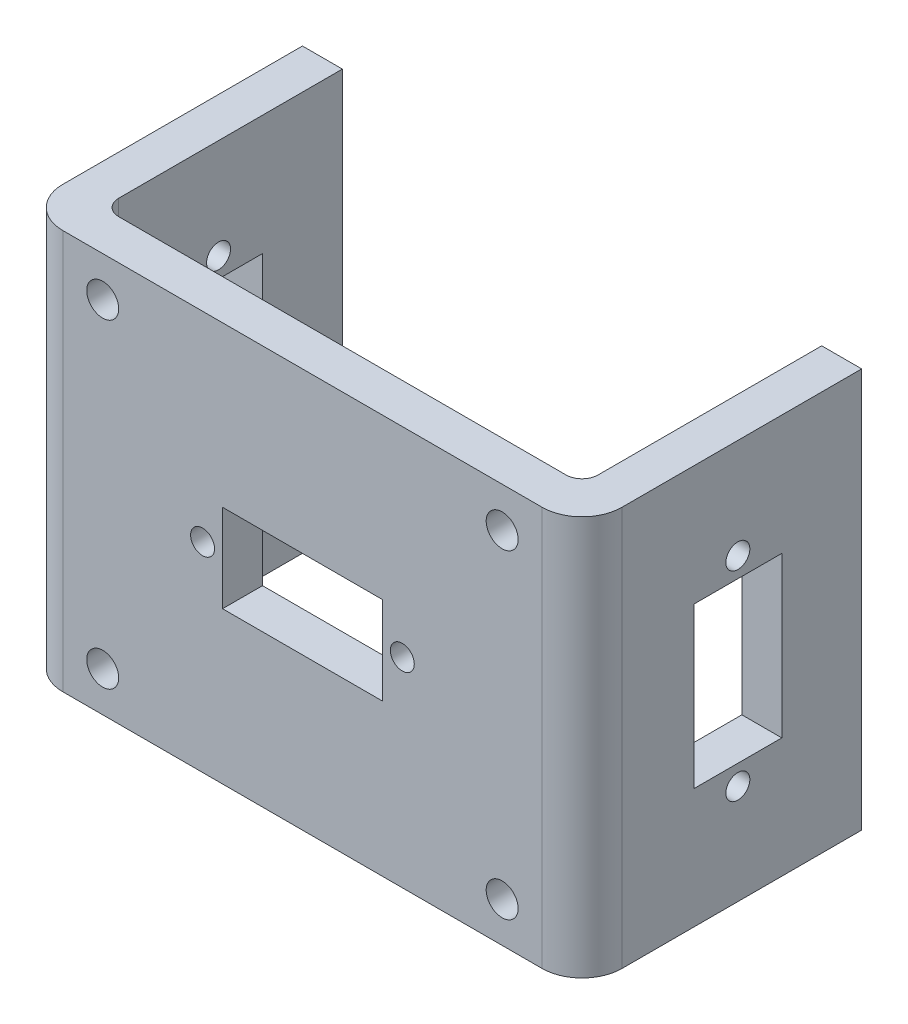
ISO-10303-21;
HEADER;
FILE_DESCRIPTION(('STEP AP214'),'2;1');
FILE_NAME('part.step','',(''),(''),'','','');
FILE_SCHEMA(('AUTOMOTIVE_DESIGN { 1 0 10303 214 1 1 1 1 }'));
ENDSEC;
DATA;
#1=APPLICATION_CONTEXT('core data for automotive mechanical design processes');
#2=APPLICATION_PROTOCOL_DEFINITION('international standard','automotive_design',2000,#1);
#3=PRODUCT_CONTEXT('',#1,'mechanical');
#4=PRODUCT('Part','Part','',(#3));
#5=PRODUCT_RELATED_PRODUCT_CATEGORY('part','',(#4));
#6=PRODUCT_DEFINITION_FORMATION('','',#4);
#7=PRODUCT_DEFINITION_CONTEXT('part definition',#1,'design');
#8=PRODUCT_DEFINITION('design','',#6,#7);
#9=PRODUCT_DEFINITION_SHAPE('','',#8);
#10=(LENGTH_UNIT() NAMED_UNIT(*) SI_UNIT(.MILLI.,.METRE.));
#11=(NAMED_UNIT(*) PLANE_ANGLE_UNIT() SI_UNIT($,.RADIAN.));
#12=(NAMED_UNIT(*) SI_UNIT($,.STERADIAN.) SOLID_ANGLE_UNIT());
#13=UNCERTAINTY_MEASURE_WITH_UNIT(LENGTH_MEASURE(1.E-05),#10,'distance_accuracy_value','');
#14=(GEOMETRIC_REPRESENTATION_CONTEXT(3) GLOBAL_UNCERTAINTY_ASSIGNED_CONTEXT((#13)) GLOBAL_UNIT_ASSIGNED_CONTEXT((#10,
#11,#12)) REPRESENTATION_CONTEXT('',''));
#15=CARTESIAN_POINT('',(0.,0.,0.));
#16=DIRECTION('',(0.,0.,1.));
#17=DIRECTION('',(1.,0.,0.));
#18=AXIS2_PLACEMENT_3D('',#15,#16,#17);
#19=CARTESIAN_POINT('',(0.,50.,0.));
#20=DIRECTION('',(0.,0.,-1.));
#21=DIRECTION('',(-1.,0.,0.));
#22=AXIS2_PLACEMENT_3D('',#19,#20,#21);
#23=PLANE('',#22);
#24=DIRECTION('',(0.,1.,0.));
#25=VECTOR('',#24,1.);
#26=CARTESIAN_POINT('',(65.,0.,0.));
#27=LINE('',#26,#25);
#28=CARTESIAN_POINT('',(65.,0.,0.));
#29=VERTEX_POINT('',#28);
#30=CARTESIAN_POINT('',(65.,50.,0.));
#31=VERTEX_POINT('',#30);
#32=EDGE_CURVE('E339',#29,#31,#27,.T.);
#33=ORIENTED_EDGE('',*,*,#32,.T.);
#34=DIRECTION('',(-1.,0.,0.));
#35=VECTOR('',#34,1.);
#36=CARTESIAN_POINT('',(0.,50.,0.));
#37=LINE('',#36,#35);
#38=CARTESIAN_POINT('',(70.,50.,0.));
#39=VERTEX_POINT('',#38);
#40=EDGE_CURVE('E369',#39,#31,#37,.T.);
#41=ORIENTED_EDGE('',*,*,#40,.F.);
#42=DIRECTION('',(0.,1.,0.));
#43=VECTOR('',#42,1.);
#44=CARTESIAN_POINT('',(70.,0.,0.));
#45=LINE('',#44,#43);
#46=CARTESIAN_POINT('',(70.,0.,0.));
#47=VERTEX_POINT('',#46);
#48=EDGE_CURVE('E379',#47,#39,#45,.T.);
#49=ORIENTED_EDGE('',*,*,#48,.F.);
#50=DIRECTION('',(1.,0.,0.));
#51=VECTOR('',#50,1.);
#52=CARTESIAN_POINT('',(0.,0.,0.));
#53=LINE('',#52,#51);
#54=EDGE_CURVE('E375',#29,#47,#53,.T.);
#55=ORIENTED_EDGE('',*,*,#54,.F.);
#56=EDGE_LOOP('',(#33,#41,#49,#55));
#57=FACE_BOUND('',#56,.T.);
#58=ADVANCED_FACE('F30',(#57),#23,.T.);
#59=CARTESIAN_POINT('',(0.,0.,35.));
#60=DIRECTION('',(1.,0.,0.));
#61=DIRECTION('',(0.,1.,0.));
#62=AXIS2_PLACEMENT_3D('',#59,#60,#61);
#63=PLANE('',#62);
#64=CARTESIAN_POINT('',(0.,37.5,15.5));
#65=DIRECTION('',(-1.,0.,0.));
#66=DIRECTION('',(0.,-1.,0.));
#67=AXIS2_PLACEMENT_3D('',#64,#65,#66);
#68=CIRCLE('',#67,1.5);
#69=CARTESIAN_POINT('',(0.,36.,15.5));
#70=VERTEX_POINT('',#69);
#71=EDGE_CURVE('E207',#70,#70,#68,.T.);
#72=ORIENTED_EDGE('',*,*,#71,.F.);
#73=EDGE_LOOP('',(#72));
#74=FACE_BOUND('',#73,.T.);
#75=CARTESIAN_POINT('',(0.,12.5,15.5));
#76=DIRECTION('',(-1.,0.,0.));
#77=DIRECTION('',(0.,-1.,0.));
#78=AXIS2_PLACEMENT_3D('',#75,#76,#77);
#79=CIRCLE('',#78,1.5);
#80=CARTESIAN_POINT('',(0.,11.,15.5));
#81=VERTEX_POINT('',#80);
#82=EDGE_CURVE('E238',#81,#81,#79,.T.);
#83=ORIENTED_EDGE('',*,*,#82,.F.);
#84=EDGE_LOOP('',(#83));
#85=FACE_BOUND('',#84,.T.);
#86=DIRECTION('',(0.,0.,1.));
#87=VECTOR('',#86,1.);
#88=CARTESIAN_POINT('',(0.,15.,10.));
#89=LINE('',#88,#87);
#90=CARTESIAN_POINT('',(0.,15.,10.));
#91=VERTEX_POINT('',#90);
#92=CARTESIAN_POINT('',(0.,15.,21.));
#93=VERTEX_POINT('',#92);
#94=EDGE_CURVE('E264',#91,#93,#89,.T.);
#95=ORIENTED_EDGE('',*,*,#94,.F.);
#96=DIRECTION('',(0.,-1.,0.));
#97=VECTOR('',#96,1.);
#98=CARTESIAN_POINT('',(0.,35.,10.));
#99=LINE('',#98,#97);
#100=CARTESIAN_POINT('',(0.,35.,10.));
#101=VERTEX_POINT('',#100);
#102=EDGE_CURVE('E248',#101,#91,#99,.T.);
#103=ORIENTED_EDGE('',*,*,#102,.F.);
#104=DIRECTION('',(0.,0.,-1.));
#105=VECTOR('',#104,1.);
#106=CARTESIAN_POINT('',(0.,35.,10.));
#107=LINE('',#106,#105);
#108=CARTESIAN_POINT('',(0.,35.,21.));
#109=VERTEX_POINT('',#108);
#110=EDGE_CURVE('E253',#109,#101,#107,.T.);
#111=ORIENTED_EDGE('',*,*,#110,.F.);
#112=DIRECTION('',(0.,1.,0.));
#113=VECTOR('',#112,1.);
#114=CARTESIAN_POINT('',(0.,35.,21.));
#115=LINE('',#114,#113);
#116=EDGE_CURVE('E267',#93,#109,#115,.T.);
#117=ORIENTED_EDGE('',*,*,#116,.F.);
#118=EDGE_LOOP('',(#95,#103,#111,#117));
#119=FACE_BOUND('',#118,.T.);
#120=DIRECTION('',(0.,0.,-1.));
#121=VECTOR('',#120,1.);
#122=CARTESIAN_POINT('',(0.,0.,35.));
#123=LINE('',#122,#121);
#124=CARTESIAN_POINT('',(0.,0.,30.));
#125=VERTEX_POINT('',#124);
#126=CARTESIAN_POINT('',(0.,0.,0.));
#127=VERTEX_POINT('',#126);
#128=EDGE_CURVE('E392',#125,#127,#123,.T.);
#129=ORIENTED_EDGE('',*,*,#128,.F.);
#130=DIRECTION('',(0.,-1.,0.));
#131=VECTOR('',#130,1.);
#132=CARTESIAN_POINT('',(0.,0.,30.));
#133=LINE('',#132,#131);
#134=CARTESIAN_POINT('',(0.,50.,30.));
#135=VERTEX_POINT('',#134);
#136=EDGE_CURVE('E410',#125,#135,#133,.F.);
#137=ORIENTED_EDGE('',*,*,#136,.T.);
#138=DIRECTION('',(0.,0.,-1.));
#139=VECTOR('',#138,1.);
#140=CARTESIAN_POINT('',(0.,50.,35.));
#141=LINE('',#140,#139);
#142=CARTESIAN_POINT('',(0.,50.,0.));
#143=VERTEX_POINT('',#142);
#144=EDGE_CURVE('E372',#135,#143,#141,.T.);
#145=ORIENTED_EDGE('',*,*,#144,.T.);
#146=DIRECTION('',(0.,-1.,0.));
#147=VECTOR('',#146,1.);
#148=CARTESIAN_POINT('',(0.,0.,0.));
#149=LINE('',#148,#147);
#150=EDGE_CURVE('E354',#143,#127,#149,.T.);
#151=ORIENTED_EDGE('',*,*,#150,.T.);
#152=EDGE_LOOP('',(#129,#137,#145,#151));
#153=FACE_BOUND('',#152,.T.);
#154=ADVANCED_FACE('F444',(#74,#85,#119,#153),#63,.F.);
#155=CARTESIAN_POINT('',(0.,0.,35.));
#156=DIRECTION('',(0.,1.,0.));
#157=DIRECTION('',(0.,0.,1.));
#158=AXIS2_PLACEMENT_3D('',#155,#156,#157);
#159=PLANE('',#158);
#160=CARTESIAN_POINT('',(63.,0.,28.));
#161=DIRECTION('',(0.,1.,0.));
#162=DIRECTION('',(0.,0.,1.));
#163=AXIS2_PLACEMENT_3D('',#160,#161,#162);
#164=CIRCLE('',#163,1.99999999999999);
#165=CARTESIAN_POINT('',(63.,0.,30.));
#166=VERTEX_POINT('',#165);
#167=CARTESIAN_POINT('',(65.,0.,28.));
#168=VERTEX_POINT('',#167);
#169=EDGE_CURVE('E336',#166,#168,#164,.T.);
#170=ORIENTED_EDGE('',*,*,#169,.T.);
#171=DIRECTION('',(0.,0.,-1.));
#172=VECTOR('',#171,1.);
#173=CARTESIAN_POINT('',(65.,0.,0.));
#174=LINE('',#173,#172);
#175=EDGE_CURVE('E323',#168,#29,#174,.T.);
#176=ORIENTED_EDGE('',*,*,#175,.T.);
#177=ORIENTED_EDGE('',*,*,#54,.T.);
#178=DIRECTION('',(0.,0.,-1.));
#179=VECTOR('',#178,1.);
#180=CARTESIAN_POINT('',(70.,0.,35.));
#181=LINE('',#180,#179);
#182=CARTESIAN_POINT('',(70.,0.,30.));
#183=VERTEX_POINT('',#182);
#184=EDGE_CURVE('E389',#183,#47,#181,.T.);
#185=ORIENTED_EDGE('',*,*,#184,.F.);
#186=CARTESIAN_POINT('',(65.,0.,30.));
#187=DIRECTION('',(0.,1.,0.));
#188=DIRECTION('',(0.,0.,1.));
#189=AXIS2_PLACEMENT_3D('',#186,#187,#188);
#190=CIRCLE('',#189,5.);
#191=CARTESIAN_POINT('',(65.,0.,35.));
#192=VERTEX_POINT('',#191);
#193=EDGE_CURVE('E408',#183,#192,#190,.F.);
#194=ORIENTED_EDGE('',*,*,#193,.T.);
#195=DIRECTION('',(1.,0.,0.));
#196=VECTOR('',#195,1.);
#197=CARTESIAN_POINT('',(0.,0.,35.));
#198=LINE('',#197,#196);
#199=CARTESIAN_POINT('',(5.,0.,35.));
#200=VERTEX_POINT('',#199);
#201=EDGE_CURVE('E365',#200,#192,#198,.T.);
#202=ORIENTED_EDGE('',*,*,#201,.F.);
#203=CARTESIAN_POINT('',(5.,0.,30.));
#204=DIRECTION('',(0.,1.,0.));
#205=DIRECTION('',(0.,0.,1.));
#206=AXIS2_PLACEMENT_3D('',#203,#204,#205);
#207=CIRCLE('',#206,5.);
#208=EDGE_CURVE('E406',#200,#125,#207,.F.);
#209=ORIENTED_EDGE('',*,*,#208,.T.);
#210=ORIENTED_EDGE('',*,*,#128,.T.);
#211=CARTESIAN_POINT('',(4.99999999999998,0.,0.));
#212=VERTEX_POINT('',#211);
#213=EDGE_CURVE('E376',#127,#212,#53,.T.);
#214=ORIENTED_EDGE('',*,*,#213,.T.);
#215=DIRECTION('',(0.,0.,1.));
#216=VECTOR('',#215,1.);
#217=CARTESIAN_POINT('',(4.99999999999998,0.,0.));
#218=LINE('',#217,#216);
#219=CARTESIAN_POINT('',(4.99999999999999,0.,28.));
#220=VERTEX_POINT('',#219);
#221=EDGE_CURVE('E326',#212,#220,#218,.T.);
#222=ORIENTED_EDGE('',*,*,#221,.T.);
#223=CARTESIAN_POINT('',(6.99999999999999,0.,28.));
#224=DIRECTION('',(0.,1.,0.));
#225=DIRECTION('',(0.,0.,1.));
#226=AXIS2_PLACEMENT_3D('',#223,#224,#225);
#227=CIRCLE('',#226,2.);
#228=CARTESIAN_POINT('',(6.99999999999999,0.,30.));
#229=VERTEX_POINT('',#228);
#230=EDGE_CURVE('E330',#220,#229,#227,.T.);
#231=ORIENTED_EDGE('',*,*,#230,.T.);
#232=DIRECTION('',(1.,0.,0.));
#233=VECTOR('',#232,1.);
#234=CARTESIAN_POINT('',(63.,0.,30.));
#235=LINE('',#234,#233);
#236=EDGE_CURVE('E333',#229,#166,#235,.T.);
#237=ORIENTED_EDGE('',*,*,#236,.T.);
#238=EDGE_LOOP('',(#170,#176,#177,#185,#194,#202,#209,#210,#214,#222,#231,#237));
#239=FACE_BOUND('',#238,.T.);
#240=ADVANCED_FACE('F451',(#239),#159,.F.);
#241=CARTESIAN_POINT('',(70.,0.,35.));
#242=DIRECTION('',(-1.,0.,0.));
#243=DIRECTION('',(0.,-1.,0.));
#244=AXIS2_PLACEMENT_3D('',#241,#242,#243);
#245=PLANE('',#244);
#246=CARTESIAN_POINT('',(70.,37.5,15.5));
#247=DIRECTION('',(-1.,0.,0.));
#248=DIRECTION('',(0.,-1.,0.));
#249=AXIS2_PLACEMENT_3D('',#246,#247,#248);
#250=CIRCLE('',#249,1.5);
#251=CARTESIAN_POINT('',(70.,36.,15.5));
#252=VERTEX_POINT('',#251);
#253=EDGE_CURVE('E230',#252,#252,#250,.T.);
#254=ORIENTED_EDGE('',*,*,#253,.T.);
#255=EDGE_LOOP('',(#254));
#256=FACE_BOUND('',#255,.T.);
#257=CARTESIAN_POINT('',(70.,12.5,15.5));
#258=DIRECTION('',(-1.,0.,0.));
#259=DIRECTION('',(0.,-1.,0.));
#260=AXIS2_PLACEMENT_3D('',#257,#258,#259);
#261=CIRCLE('',#260,1.5);
#262=CARTESIAN_POINT('',(70.,11.,15.5));
#263=VERTEX_POINT('',#262);
#264=EDGE_CURVE('E239',#263,#263,#261,.T.);
#265=ORIENTED_EDGE('',*,*,#264,.T.);
#266=EDGE_LOOP('',(#265));
#267=FACE_BOUND('',#266,.T.);
#268=DIRECTION('',(0.,0.,-1.));
#269=VECTOR('',#268,1.);
#270=CARTESIAN_POINT('',(70.,35.,10.));
#271=LINE('',#270,#269);
#272=CARTESIAN_POINT('',(70.,35.,21.));
#273=VERTEX_POINT('',#272);
#274=CARTESIAN_POINT('',(70.,35.,10.));
#275=VERTEX_POINT('',#274);
#276=EDGE_CURVE('E259',#273,#275,#271,.T.);
#277=ORIENTED_EDGE('',*,*,#276,.T.);
#278=DIRECTION('',(0.,-1.,0.));
#279=VECTOR('',#278,1.);
#280=CARTESIAN_POINT('',(70.,35.,10.));
#281=LINE('',#280,#279);
#282=CARTESIAN_POINT('',(70.,15.,10.));
#283=VERTEX_POINT('',#282);
#284=EDGE_CURVE('E249',#275,#283,#281,.T.);
#285=ORIENTED_EDGE('',*,*,#284,.T.);
#286=DIRECTION('',(0.,0.,1.));
#287=VECTOR('',#286,1.);
#288=CARTESIAN_POINT('',(70.,15.,10.));
#289=LINE('',#288,#287);
#290=CARTESIAN_POINT('',(70.,15.,21.));
#291=VERTEX_POINT('',#290);
#292=EDGE_CURVE('E252',#283,#291,#289,.T.);
#293=ORIENTED_EDGE('',*,*,#292,.T.);
#294=DIRECTION('',(0.,1.,0.));
#295=VECTOR('',#294,1.);
#296=CARTESIAN_POINT('',(70.,35.,21.));
#297=LINE('',#296,#295);
#298=EDGE_CURVE('E256',#291,#273,#297,.T.);
#299=ORIENTED_EDGE('',*,*,#298,.T.);
#300=EDGE_LOOP('',(#277,#285,#293,#299));
#301=FACE_BOUND('',#300,.T.);
#302=DIRECTION('',(0.,0.,-1.));
#303=VECTOR('',#302,1.);
#304=CARTESIAN_POINT('',(70.,50.,35.));
#305=LINE('',#304,#303);
#306=CARTESIAN_POINT('',(70.,50.,30.));
#307=VERTEX_POINT('',#306);
#308=EDGE_CURVE('E387',#307,#39,#305,.T.);
#309=ORIENTED_EDGE('',*,*,#308,.F.);
#310=DIRECTION('',(0.,1.,0.));
#311=VECTOR('',#310,1.);
#312=CARTESIAN_POINT('',(70.,0.,30.));
#313=LINE('',#312,#311);
#314=EDGE_CURVE('E404',#307,#183,#313,.F.);
#315=ORIENTED_EDGE('',*,*,#314,.T.);
#316=ORIENTED_EDGE('',*,*,#184,.T.);
#317=ORIENTED_EDGE('',*,*,#48,.T.);
#318=EDGE_LOOP('',(#309,#315,#316,#317));
#319=FACE_BOUND('',#318,.T.);
#320=ADVANCED_FACE('F490',(#256,#267,#301,#319),#245,.F.);
#321=CARTESIAN_POINT('',(0.,50.,35.));
#322=DIRECTION('',(0.,-1.,0.));
#323=DIRECTION('',(0.,0.,-1.));
#324=AXIS2_PLACEMENT_3D('',#321,#322,#323);
#325=PLANE('',#324);
#326=ORIENTED_EDGE('',*,*,#40,.T.);
#327=DIRECTION('',(0.,0.,-1.));
#328=VECTOR('',#327,1.);
#329=CARTESIAN_POINT('',(65.,50.,0.));
#330=LINE('',#329,#328);
#331=CARTESIAN_POINT('',(65.,50.,28.));
#332=VERTEX_POINT('',#331);
#333=EDGE_CURVE('E322',#332,#31,#330,.T.);
#334=ORIENTED_EDGE('',*,*,#333,.F.);
#335=CARTESIAN_POINT('',(63.,50.,28.));
#336=DIRECTION('',(0.,1.,0.));
#337=DIRECTION('',(0.,0.,1.));
#338=AXIS2_PLACEMENT_3D('',#335,#336,#337);
#339=CIRCLE('',#338,1.99999999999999);
#340=CARTESIAN_POINT('',(63.,50.,30.));
#341=VERTEX_POINT('',#340);
#342=EDGE_CURVE('E327',#341,#332,#339,.T.);
#343=ORIENTED_EDGE('',*,*,#342,.F.);
#344=DIRECTION('',(1.,0.,0.));
#345=VECTOR('',#344,1.);
#346=CARTESIAN_POINT('',(63.,50.,30.));
#347=LINE('',#346,#345);
#348=CARTESIAN_POINT('',(6.99999999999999,50.,30.));
#349=VERTEX_POINT('',#348);
#350=EDGE_CURVE('E347',#349,#341,#347,.T.);
#351=ORIENTED_EDGE('',*,*,#350,.F.);
#352=CARTESIAN_POINT('',(6.99999999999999,50.,28.));
#353=DIRECTION('',(0.,1.,0.));
#354=DIRECTION('',(0.,0.,1.));
#355=AXIS2_PLACEMENT_3D('',#352,#353,#354);
#356=CIRCLE('',#355,2.);
#357=CARTESIAN_POINT('',(4.99999999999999,50.,28.));
#358=VERTEX_POINT('',#357);
#359=EDGE_CURVE('E344',#358,#349,#356,.T.);
#360=ORIENTED_EDGE('',*,*,#359,.F.);
#361=DIRECTION('',(0.,0.,1.));
#362=VECTOR('',#361,1.);
#363=CARTESIAN_POINT('',(4.99999999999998,50.,0.));
#364=LINE('',#363,#362);
#365=CARTESIAN_POINT('',(4.99999999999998,50.,0.));
#366=VERTEX_POINT('',#365);
#367=EDGE_CURVE('E341',#366,#358,#364,.T.);
#368=ORIENTED_EDGE('',*,*,#367,.F.);
#369=EDGE_CURVE('E382',#366,#143,#37,.T.);
#370=ORIENTED_EDGE('',*,*,#369,.T.);
#371=ORIENTED_EDGE('',*,*,#144,.F.);
#372=CARTESIAN_POINT('',(4.99999999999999,50.,30.));
#373=DIRECTION('',(0.,-1.,0.));
#374=DIRECTION('',(0.,0.,-1.));
#375=AXIS2_PLACEMENT_3D('',#372,#373,#374);
#376=CIRCLE('',#375,5.);
#377=CARTESIAN_POINT('',(4.99999999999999,50.,35.));
#378=VERTEX_POINT('',#377);
#379=EDGE_CURVE('E400',#135,#378,#376,.F.);
#380=ORIENTED_EDGE('',*,*,#379,.T.);
#381=DIRECTION('',(-1.,0.,0.));
#382=VECTOR('',#381,1.);
#383=CARTESIAN_POINT('',(0.,50.,35.));
#384=LINE('',#383,#382);
#385=CARTESIAN_POINT('',(65.,50.,35.));
#386=VERTEX_POINT('',#385);
#387=EDGE_CURVE('E368',#386,#378,#384,.T.);
#388=ORIENTED_EDGE('',*,*,#387,.F.);
#389=CARTESIAN_POINT('',(65.,50.,30.));
#390=DIRECTION('',(0.,-1.,0.));
#391=DIRECTION('',(0.,0.,-1.));
#392=AXIS2_PLACEMENT_3D('',#389,#390,#391);
#393=CIRCLE('',#392,5.);
#394=EDGE_CURVE('E402',#386,#307,#393,.F.);
#395=ORIENTED_EDGE('',*,*,#394,.T.);
#396=ORIENTED_EDGE('',*,*,#308,.T.);
#397=EDGE_LOOP('',(#326,#334,#343,#351,#360,#368,#370,#371,#380,#388,#395,#396));
#398=FACE_BOUND('',#397,.T.);
#399=ADVANCED_FACE('F465',(#398),#325,.F.);
#400=CARTESIAN_POINT('',(0.,50.,35.));
#401=DIRECTION('',(0.,0.,-1.));
#402=DIRECTION('',(-1.,0.,0.));
#403=AXIS2_PLACEMENT_3D('',#400,#401,#402);
#404=PLANE('',#403);
#405=CARTESIAN_POINT('',(47.5,25.,35.));
#406=DIRECTION('',(0.,0.,1.));
#407=DIRECTION('',(1.,0.,0.));
#408=AXIS2_PLACEMENT_3D('',#405,#406,#407);
#409=CIRCLE('',#408,1.5);
#410=CARTESIAN_POINT('',(49.,25.,35.));
#411=VERTEX_POINT('',#410);
#412=EDGE_CURVE('E608',#411,#411,#409,.T.);
#413=ORIENTED_EDGE('',*,*,#412,.F.);
#414=EDGE_LOOP('',(#413));
#415=FACE_BOUND('',#414,.T.);
#416=CARTESIAN_POINT('',(22.5,25.,35.));
#417=DIRECTION('',(0.,0.,1.));
#418=DIRECTION('',(1.,0.,0.));
#419=AXIS2_PLACEMENT_3D('',#416,#417,#418);
#420=CIRCLE('',#419,1.5);
#421=CARTESIAN_POINT('',(24.,25.,35.));
#422=VERTEX_POINT('',#421);
#423=EDGE_CURVE('E602',#422,#422,#420,.T.);
#424=ORIENTED_EDGE('',*,*,#423,.F.);
#425=EDGE_LOOP('',(#424));
#426=FACE_BOUND('',#425,.T.);
#427=DIRECTION('',(1.,0.,0.));
#428=VECTOR('',#427,1.);
#429=CARTESIAN_POINT('',(25.,19.,35.));
#430=LINE('',#429,#428);
#431=CARTESIAN_POINT('',(25.,19.,35.));
#432=VERTEX_POINT('',#431);
#433=CARTESIAN_POINT('',(45.,19.,35.));
#434=VERTEX_POINT('',#433);
#435=EDGE_CURVE('E215',#432,#434,#430,.T.);
#436=ORIENTED_EDGE('',*,*,#435,.F.);
#437=DIRECTION('',(0.,-1.,0.));
#438=VECTOR('',#437,1.);
#439=CARTESIAN_POINT('',(25.,19.,35.));
#440=LINE('',#439,#438);
#441=CARTESIAN_POINT('',(25.,30.,35.));
#442=VERTEX_POINT('',#441);
#443=EDGE_CURVE('E47',#442,#432,#440,.T.);
#444=ORIENTED_EDGE('',*,*,#443,.F.);
#445=DIRECTION('',(-1.,0.,0.));
#446=VECTOR('',#445,1.);
#447=CARTESIAN_POINT('',(25.,30.,35.));
#448=LINE('',#447,#446);
#449=CARTESIAN_POINT('',(45.,30.,35.));
#450=VERTEX_POINT('',#449);
#451=EDGE_CURVE('E201',#450,#442,#448,.T.);
#452=ORIENTED_EDGE('',*,*,#451,.F.);
#453=DIRECTION('',(0.,1.,0.));
#454=VECTOR('',#453,1.);
#455=CARTESIAN_POINT('',(45.,19.,35.));
#456=LINE('',#455,#454);
#457=EDGE_CURVE('E221',#434,#450,#456,.T.);
#458=ORIENTED_EDGE('',*,*,#457,.F.);
#459=EDGE_LOOP('',(#436,#444,#452,#458));
#460=FACE_BOUND('',#459,.T.);
#461=CARTESIAN_POINT('',(60.,45.,35.));
#462=DIRECTION('',(0.,0.,1.));
#463=DIRECTION('',(1.,0.,0.));
#464=AXIS2_PLACEMENT_3D('',#461,#462,#463);
#465=CIRCLE('',#464,2.);
#466=CARTESIAN_POINT('',(62.,45.,35.));
#467=VERTEX_POINT('',#466);
#468=EDGE_CURVE('E298',#467,#467,#465,.T.);
#469=ORIENTED_EDGE('',*,*,#468,.F.);
#470=EDGE_LOOP('',(#469));
#471=FACE_BOUND('',#470,.T.);
#472=CARTESIAN_POINT('',(60.,5.,35.));
#473=DIRECTION('',(0.,0.,1.));
#474=DIRECTION('',(1.,0.,0.));
#475=AXIS2_PLACEMENT_3D('',#472,#473,#474);
#476=CIRCLE('',#475,2.);
#477=CARTESIAN_POINT('',(62.,5.,35.));
#478=VERTEX_POINT('',#477);
#479=EDGE_CURVE('E304',#478,#478,#476,.T.);
#480=ORIENTED_EDGE('',*,*,#479,.F.);
#481=EDGE_LOOP('',(#480));
#482=FACE_BOUND('',#481,.T.);
#483=CARTESIAN_POINT('',(9.99999999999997,5.00000000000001,35.));
#484=DIRECTION('',(0.,0.,1.));
#485=DIRECTION('',(1.,0.,0.));
#486=AXIS2_PLACEMENT_3D('',#483,#484,#485);
#487=CIRCLE('',#486,2.);
#488=CARTESIAN_POINT('',(12.,5.00000000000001,35.));
#489=VERTEX_POINT('',#488);
#490=EDGE_CURVE('E310',#489,#489,#487,.T.);
#491=ORIENTED_EDGE('',*,*,#490,.F.);
#492=EDGE_LOOP('',(#491));
#493=FACE_BOUND('',#492,.T.);
#494=CARTESIAN_POINT('',(9.99999999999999,45.,35.));
#495=DIRECTION('',(0.,0.,1.));
#496=DIRECTION('',(1.,0.,0.));
#497=AXIS2_PLACEMENT_3D('',#494,#495,#496);
#498=CIRCLE('',#497,2.);
#499=CARTESIAN_POINT('',(12.,45.,35.));
#500=VERTEX_POINT('',#499);
#501=EDGE_CURVE('E316',#500,#500,#498,.T.);
#502=ORIENTED_EDGE('',*,*,#501,.F.);
#503=EDGE_LOOP('',(#502));
#504=FACE_BOUND('',#503,.T.);
#505=ORIENTED_EDGE('',*,*,#201,.T.);
#506=DIRECTION('',(0.,1.,0.));
#507=VECTOR('',#506,1.);
#508=CARTESIAN_POINT('',(65.,50.,35.));
#509=LINE('',#508,#507);
#510=EDGE_CURVE('E397',#192,#386,#509,.T.);
#511=ORIENTED_EDGE('',*,*,#510,.T.);
#512=ORIENTED_EDGE('',*,*,#387,.T.);
#513=DIRECTION('',(0.,-1.,0.));
#514=VECTOR('',#513,1.);
#515=CARTESIAN_POINT('',(4.99999999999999,50.,35.));
#516=LINE('',#515,#514);
#517=EDGE_CURVE('E394',#378,#200,#516,.T.);
#518=ORIENTED_EDGE('',*,*,#517,.T.);
#519=EDGE_LOOP('',(#505,#511,#512,#518));
#520=FACE_BOUND('',#519,.T.);
#521=ADVANCED_FACE('F458',(#415,#426,#460,#471,#482,#493,#504,#520),#404,.F.);
#522=DIRECTION('',(0.,1.,0.));
#523=VECTOR('',#522,1.);
#524=CARTESIAN_POINT('',(4.99999999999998,0.,0.));
#525=LINE('',#524,#523);
#526=EDGE_CURVE('E361',#212,#366,#525,.T.);
#527=ORIENTED_EDGE('',*,*,#526,.F.);
#528=ORIENTED_EDGE('',*,*,#213,.F.);
#529=ORIENTED_EDGE('',*,*,#150,.F.);
#530=ORIENTED_EDGE('',*,*,#369,.F.);
#531=EDGE_LOOP('',(#527,#528,#529,#530));
#532=FACE_BOUND('',#531,.T.);
#533=ADVANCED_FACE('F447',(#532),#23,.T.);
#534=CARTESIAN_POINT('',(65.,50.,30.));
#535=DIRECTION('',(0.,1.,0.));
#536=DIRECTION('',(-1.,0.,0.));
#537=AXIS2_PLACEMENT_3D('',#534,#535,#536);
#538=CYLINDRICAL_SURFACE('',#537,5.);
#539=ORIENTED_EDGE('',*,*,#193,.F.);
#540=ORIENTED_EDGE('',*,*,#314,.F.);
#541=ORIENTED_EDGE('',*,*,#394,.F.);
#542=ORIENTED_EDGE('',*,*,#510,.F.);
#543=EDGE_LOOP('',(#539,#540,#541,#542));
#544=FACE_BOUND('',#543,.T.);
#545=ADVANCED_FACE('F457',(#544),#538,.T.);
#546=CARTESIAN_POINT('',(4.99999999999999,50.,30.));
#547=DIRECTION('',(0.,-1.,0.));
#548=DIRECTION('',(1.,0.,0.));
#549=AXIS2_PLACEMENT_3D('',#546,#547,#548);
#550=CYLINDRICAL_SURFACE('',#549,5.);
#551=ORIENTED_EDGE('',*,*,#379,.F.);
#552=ORIENTED_EDGE('',*,*,#136,.F.);
#553=ORIENTED_EDGE('',*,*,#208,.F.);
#554=ORIENTED_EDGE('',*,*,#517,.F.);
#555=EDGE_LOOP('',(#551,#552,#553,#554));
#556=FACE_BOUND('',#555,.T.);
#557=ADVANCED_FACE('F32',(#556),#550,.T.);
#558=CARTESIAN_POINT('',(65.,0.,0.));
#559=DIRECTION('',(1.,0.,0.));
#560=DIRECTION('',(0.,0.,-1.));
#561=AXIS2_PLACEMENT_3D('',#558,#559,#560);
#562=PLANE('',#561);
#563=CARTESIAN_POINT('',(65.,37.5,15.5));
#564=DIRECTION('',(1.,0.,0.));
#565=DIRECTION('',(0.,0.,-1.));
#566=AXIS2_PLACEMENT_3D('',#563,#564,#565);
#567=CIRCLE('',#566,1.5);
#568=CARTESIAN_POINT('',(65.,37.5,14.));
#569=VERTEX_POINT('',#568);
#570=EDGE_CURVE('E235',#569,#569,#567,.T.);
#571=ORIENTED_EDGE('',*,*,#570,.T.);
#572=EDGE_LOOP('',(#571));
#573=FACE_BOUND('',#572,.T.);
#574=CARTESIAN_POINT('',(65.,12.5,15.5));
#575=DIRECTION('',(1.,0.,0.));
#576=DIRECTION('',(0.,0.,-1.));
#577=AXIS2_PLACEMENT_3D('',#574,#575,#576);
#578=CIRCLE('',#577,1.5);
#579=CARTESIAN_POINT('',(65.,12.5,14.));
#580=VERTEX_POINT('',#579);
#581=EDGE_CURVE('E245',#580,#580,#578,.T.);
#582=ORIENTED_EDGE('',*,*,#581,.T.);
#583=EDGE_LOOP('',(#582));
#584=FACE_BOUND('',#583,.T.);
#585=DIRECTION('',(0.,0.,-1.));
#586=VECTOR('',#585,1.);
#587=CARTESIAN_POINT('',(65.,15.,0.));
#588=LINE('',#587,#586);
#589=CARTESIAN_POINT('',(65.,15.,21.));
#590=VERTEX_POINT('',#589);
#591=CARTESIAN_POINT('',(65.,15.,10.));
#592=VERTEX_POINT('',#591);
#593=EDGE_CURVE('E275',#590,#592,#588,.T.);
#594=ORIENTED_EDGE('',*,*,#593,.T.);
#595=DIRECTION('',(0.,1.,0.));
#596=VECTOR('',#595,1.);
#597=CARTESIAN_POINT('',(65.,0.,10.));
#598=LINE('',#597,#596);
#599=CARTESIAN_POINT('',(65.,35.,10.));
#600=VERTEX_POINT('',#599);
#601=EDGE_CURVE('E295',#592,#600,#598,.T.);
#602=ORIENTED_EDGE('',*,*,#601,.T.);
#603=DIRECTION('',(0.,0.,1.));
#604=VECTOR('',#603,1.);
#605=CARTESIAN_POINT('',(65.,35.,0.));
#606=LINE('',#605,#604);
#607=CARTESIAN_POINT('',(65.,35.,21.));
#608=VERTEX_POINT('',#607);
#609=EDGE_CURVE('E292',#600,#608,#606,.T.);
#610=ORIENTED_EDGE('',*,*,#609,.T.);
#611=DIRECTION('',(0.,-1.,0.));
#612=VECTOR('',#611,1.);
#613=CARTESIAN_POINT('',(65.,0.,21.));
#614=LINE('',#613,#612);
#615=EDGE_CURVE('E289',#608,#590,#614,.T.);
#616=ORIENTED_EDGE('',*,*,#615,.T.);
#617=EDGE_LOOP('',(#594,#602,#610,#616));
#618=FACE_BOUND('',#617,.T.);
#619=ORIENTED_EDGE('',*,*,#333,.T.);
#620=ORIENTED_EDGE('',*,*,#32,.F.);
#621=ORIENTED_EDGE('',*,*,#175,.F.);
#622=DIRECTION('',(0.,1.,0.));
#623=VECTOR('',#622,1.);
#624=CARTESIAN_POINT('',(65.,0.,28.));
#625=LINE('',#624,#623);
#626=EDGE_CURVE('E352',#168,#332,#625,.T.);
#627=ORIENTED_EDGE('',*,*,#626,.T.);
#628=EDGE_LOOP('',(#619,#620,#621,#627));
#629=FACE_BOUND('',#628,.T.);
#630=ADVANCED_FACE('F499',(#573,#584,#618,#629),#562,.F.);
#631=CARTESIAN_POINT('',(63.,0.,28.));
#632=DIRECTION('',(0.,1.,0.));
#633=DIRECTION('',(0.,0.,1.));
#634=AXIS2_PLACEMENT_3D('',#631,#632,#633);
#635=CYLINDRICAL_SURFACE('',#634,1.99999999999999);
#636=ORIENTED_EDGE('',*,*,#342,.T.);
#637=ORIENTED_EDGE('',*,*,#626,.F.);
#638=ORIENTED_EDGE('',*,*,#169,.F.);
#639=DIRECTION('',(0.,1.,0.));
#640=VECTOR('',#639,1.);
#641=CARTESIAN_POINT('',(63.,0.,30.));
#642=LINE('',#641,#640);
#643=EDGE_CURVE('E355',#166,#341,#642,.T.);
#644=ORIENTED_EDGE('',*,*,#643,.T.);
#645=EDGE_LOOP('',(#636,#637,#638,#644));
#646=FACE_BOUND('',#645,.T.);
#647=ADVANCED_FACE('F503',(#646),#635,.F.);
#648=CARTESIAN_POINT('',(63.,0.,30.));
#649=DIRECTION('',(0.,0.,1.));
#650=DIRECTION('',(1.,0.,0.));
#651=AXIS2_PLACEMENT_3D('',#648,#649,#650);
#652=PLANE('',#651);
#653=CARTESIAN_POINT('',(47.5,25.,30.));
#654=DIRECTION('',(0.,0.,1.));
#655=DIRECTION('',(1.,0.,0.));
#656=AXIS2_PLACEMENT_3D('',#653,#654,#655);
#657=CIRCLE('',#656,1.5);
#658=CARTESIAN_POINT('',(49.,25.,30.));
#659=VERTEX_POINT('',#658);
#660=EDGE_CURVE('E597',#659,#659,#657,.F.);
#661=ORIENTED_EDGE('',*,*,#660,.F.);
#662=EDGE_LOOP('',(#661));
#663=FACE_BOUND('',#662,.T.);
#664=CARTESIAN_POINT('',(22.5,25.,30.));
#665=DIRECTION('',(0.,0.,1.));
#666=DIRECTION('',(1.,0.,0.));
#667=AXIS2_PLACEMENT_3D('',#664,#665,#666);
#668=CIRCLE('',#667,1.5);
#669=CARTESIAN_POINT('',(24.,25.,30.));
#670=VERTEX_POINT('',#669);
#671=EDGE_CURVE('E600',#670,#670,#668,.F.);
#672=ORIENTED_EDGE('',*,*,#671,.F.);
#673=EDGE_LOOP('',(#672));
#674=FACE_BOUND('',#673,.T.);
#675=DIRECTION('',(1.,0.,0.));
#676=VECTOR('',#675,1.);
#677=CARTESIAN_POINT('',(25.,30.,30.));
#678=LINE('',#677,#676);
#679=CARTESIAN_POINT('',(25.,30.,30.));
#680=VERTEX_POINT('',#679);
#681=CARTESIAN_POINT('',(45.,30.,30.));
#682=VERTEX_POINT('',#681);
#683=EDGE_CURVE('E213',#680,#682,#678,.T.);
#684=ORIENTED_EDGE('',*,*,#683,.F.);
#685=DIRECTION('',(0.,1.,0.));
#686=VECTOR('',#685,1.);
#687=CARTESIAN_POINT('',(25.,19.,30.));
#688=LINE('',#687,#686);
#689=CARTESIAN_POINT('',(25.,19.,30.));
#690=VERTEX_POINT('',#689);
#691=EDGE_CURVE('E195',#690,#680,#688,.T.);
#692=ORIENTED_EDGE('',*,*,#691,.F.);
#693=DIRECTION('',(-1.,0.,0.));
#694=VECTOR('',#693,1.);
#695=CARTESIAN_POINT('',(25.,19.,30.));
#696=LINE('',#695,#694);
#697=CARTESIAN_POINT('',(45.,19.,30.));
#698=VERTEX_POINT('',#697);
#699=EDGE_CURVE('E204',#698,#690,#696,.T.);
#700=ORIENTED_EDGE('',*,*,#699,.F.);
#701=DIRECTION('',(0.,-1.,0.));
#702=VECTOR('',#701,1.);
#703=CARTESIAN_POINT('',(45.,19.,30.));
#704=LINE('',#703,#702);
#705=EDGE_CURVE('E55',#682,#698,#704,.T.);
#706=ORIENTED_EDGE('',*,*,#705,.F.);
#707=EDGE_LOOP('',(#684,#692,#700,#706));
#708=FACE_BOUND('',#707,.T.);
#709=CARTESIAN_POINT('',(60.,45.,30.));
#710=DIRECTION('',(0.,0.,1.));
#711=DIRECTION('',(1.,0.,0.));
#712=AXIS2_PLACEMENT_3D('',#709,#710,#711);
#713=CIRCLE('',#712,2.);
#714=CARTESIAN_POINT('',(62.,45.,30.));
#715=VERTEX_POINT('',#714);
#716=EDGE_CURVE('E301',#715,#715,#713,.F.);
#717=ORIENTED_EDGE('',*,*,#716,.F.);
#718=EDGE_LOOP('',(#717));
#719=FACE_BOUND('',#718,.T.);
#720=CARTESIAN_POINT('',(60.,5.,30.));
#721=DIRECTION('',(0.,0.,1.));
#722=DIRECTION('',(1.,0.,0.));
#723=AXIS2_PLACEMENT_3D('',#720,#721,#722);
#724=CIRCLE('',#723,2.);
#725=CARTESIAN_POINT('',(62.,5.,30.));
#726=VERTEX_POINT('',#725);
#727=EDGE_CURVE('E307',#726,#726,#724,.F.);
#728=ORIENTED_EDGE('',*,*,#727,.F.);
#729=EDGE_LOOP('',(#728));
#730=FACE_BOUND('',#729,.T.);
#731=CARTESIAN_POINT('',(9.99999999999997,5.00000000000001,30.));
#732=DIRECTION('',(0.,0.,1.));
#733=DIRECTION('',(1.,0.,0.));
#734=AXIS2_PLACEMENT_3D('',#731,#732,#733);
#735=CIRCLE('',#734,2.);
#736=CARTESIAN_POINT('',(12.,5.00000000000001,30.));
#737=VERTEX_POINT('',#736);
#738=EDGE_CURVE('E313',#737,#737,#735,.F.);
#739=ORIENTED_EDGE('',*,*,#738,.F.);
#740=EDGE_LOOP('',(#739));
#741=FACE_BOUND('',#740,.T.);
#742=CARTESIAN_POINT('',(9.99999999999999,45.,30.));
#743=DIRECTION('',(0.,0.,1.));
#744=DIRECTION('',(1.,0.,0.));
#745=AXIS2_PLACEMENT_3D('',#742,#743,#744);
#746=CIRCLE('',#745,2.);
#747=CARTESIAN_POINT('',(12.,45.,30.));
#748=VERTEX_POINT('',#747);
#749=EDGE_CURVE('E319',#748,#748,#746,.F.);
#750=ORIENTED_EDGE('',*,*,#749,.F.);
#751=EDGE_LOOP('',(#750));
#752=FACE_BOUND('',#751,.T.);
#753=ORIENTED_EDGE('',*,*,#350,.T.);
#754=ORIENTED_EDGE('',*,*,#643,.F.);
#755=ORIENTED_EDGE('',*,*,#236,.F.);
#756=DIRECTION('',(0.,1.,0.));
#757=VECTOR('',#756,1.);
#758=CARTESIAN_POINT('',(6.99999999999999,0.,30.));
#759=LINE('',#758,#757);
#760=EDGE_CURVE('E357',#229,#349,#759,.T.);
#761=ORIENTED_EDGE('',*,*,#760,.T.);
#762=EDGE_LOOP('',(#753,#754,#755,#761));
#763=FACE_BOUND('',#762,.T.);
#764=ADVANCED_FACE('F210',(#663,#674,#708,#719,#730,#741,#752,#763),#652,.F.);
#765=CARTESIAN_POINT('',(6.99999999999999,0.,28.));
#766=DIRECTION('',(0.,1.,0.));
#767=DIRECTION('',(0.,0.,1.));
#768=AXIS2_PLACEMENT_3D('',#765,#766,#767);
#769=CYLINDRICAL_SURFACE('',#768,2.);
#770=ORIENTED_EDGE('',*,*,#359,.T.);
#771=ORIENTED_EDGE('',*,*,#760,.F.);
#772=ORIENTED_EDGE('',*,*,#230,.F.);
#773=DIRECTION('',(0.,1.,0.));
#774=VECTOR('',#773,1.);
#775=CARTESIAN_POINT('',(4.99999999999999,0.,28.));
#776=LINE('',#775,#774);
#777=EDGE_CURVE('E359',#220,#358,#776,.T.);
#778=ORIENTED_EDGE('',*,*,#777,.T.);
#779=EDGE_LOOP('',(#770,#771,#772,#778));
#780=FACE_BOUND('',#779,.T.);
#781=ADVANCED_FACE('F508',(#780),#769,.F.);
#782=CARTESIAN_POINT('',(4.99999999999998,0.,0.));
#783=DIRECTION('',(-1.,0.,0.));
#784=DIRECTION('',(0.,0.,1.));
#785=AXIS2_PLACEMENT_3D('',#782,#783,#784);
#786=PLANE('',#785);
#787=CARTESIAN_POINT('',(4.99999999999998,37.5,15.5));
#788=DIRECTION('',(-1.,0.,0.));
#789=DIRECTION('',(0.,0.,1.));
#790=AXIS2_PLACEMENT_3D('',#787,#788,#789);
#791=CIRCLE('',#790,1.5);
#792=CARTESIAN_POINT('',(4.99999999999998,37.5,17.));
#793=VERTEX_POINT('',#792);
#794=EDGE_CURVE('E34',#793,#793,#791,.T.);
#795=ORIENTED_EDGE('',*,*,#794,.T.);
#796=EDGE_LOOP('',(#795));
#797=FACE_BOUND('',#796,.T.);
#798=CARTESIAN_POINT('',(4.99999999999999,12.5,15.5));
#799=DIRECTION('',(-1.,0.,0.));
#800=DIRECTION('',(0.,0.,1.));
#801=AXIS2_PLACEMENT_3D('',#798,#799,#800);
#802=CIRCLE('',#801,1.5);
#803=CARTESIAN_POINT('',(4.99999999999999,12.5,17.));
#804=VERTEX_POINT('',#803);
#805=EDGE_CURVE('E242',#804,#804,#802,.T.);
#806=ORIENTED_EDGE('',*,*,#805,.T.);
#807=EDGE_LOOP('',(#806));
#808=FACE_BOUND('',#807,.T.);
#809=DIRECTION('',(0.,0.,-1.));
#810=VECTOR('',#809,1.);
#811=CARTESIAN_POINT('',(4.99999999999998,35.,0.));
#812=LINE('',#811,#810);
#813=CARTESIAN_POINT('',(4.99999999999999,35.,21.));
#814=VERTEX_POINT('',#813);
#815=CARTESIAN_POINT('',(4.99999999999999,35.,10.));
#816=VERTEX_POINT('',#815);
#817=EDGE_CURVE('E39',#814,#816,#812,.T.);
#818=ORIENTED_EDGE('',*,*,#817,.T.);
#819=DIRECTION('',(0.,-1.,0.));
#820=VECTOR('',#819,1.);
#821=CARTESIAN_POINT('',(4.99999999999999,0.,10.));
#822=LINE('',#821,#820);
#823=CARTESIAN_POINT('',(4.99999999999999,15.,10.));
#824=VERTEX_POINT('',#823);
#825=EDGE_CURVE('E11',#816,#824,#822,.T.);
#826=ORIENTED_EDGE('',*,*,#825,.T.);
#827=DIRECTION('',(0.,0.,1.));
#828=VECTOR('',#827,1.);
#829=CARTESIAN_POINT('',(4.99999999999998,15.,0.));
#830=LINE('',#829,#828);
#831=CARTESIAN_POINT('',(4.99999999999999,15.,21.));
#832=VERTEX_POINT('',#831);
#833=EDGE_CURVE('E412',#824,#832,#830,.T.);
#834=ORIENTED_EDGE('',*,*,#833,.T.);
#835=DIRECTION('',(0.,1.,0.));
#836=VECTOR('',#835,1.);
#837=CARTESIAN_POINT('',(4.99999999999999,0.,21.));
#838=LINE('',#837,#836);
#839=EDGE_CURVE('E415',#832,#814,#838,.T.);
#840=ORIENTED_EDGE('',*,*,#839,.T.);
#841=EDGE_LOOP('',(#818,#826,#834,#840));
#842=FACE_BOUND('',#841,.T.);
#843=ORIENTED_EDGE('',*,*,#367,.T.);
#844=ORIENTED_EDGE('',*,*,#777,.F.);
#845=ORIENTED_EDGE('',*,*,#221,.F.);
#846=ORIENTED_EDGE('',*,*,#526,.T.);
#847=EDGE_LOOP('',(#843,#844,#845,#846));
#848=FACE_BOUND('',#847,.T.);
#849=ADVANCED_FACE('F422',(#797,#808,#842,#848),#786,.F.);
#850=CARTESIAN_POINT('',(9.99999999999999,45.,-0.001000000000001));
#851=DIRECTION('',(0.,0.,1.));
#852=DIRECTION('',(1.,0.,0.));
#853=AXIS2_PLACEMENT_3D('',#850,#851,#852);
#854=CYLINDRICAL_SURFACE('',#853,2.);
#855=ORIENTED_EDGE('',*,*,#501,.T.);
#856=EDGE_LOOP('',(#855));
#857=FACE_BOUND('',#856,.T.);
#858=ORIENTED_EDGE('',*,*,#749,.T.);
#859=EDGE_LOOP('',(#858));
#860=FACE_BOUND('',#859,.T.);
#861=ADVANCED_FACE('F511',(#857,#860),#854,.F.);
#862=CARTESIAN_POINT('',(9.99999999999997,5.00000000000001,-0.001000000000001));
#863=DIRECTION('',(0.,0.,1.));
#864=DIRECTION('',(1.,0.,0.));
#865=AXIS2_PLACEMENT_3D('',#862,#863,#864);
#866=CYLINDRICAL_SURFACE('',#865,2.);
#867=ORIENTED_EDGE('',*,*,#490,.T.);
#868=EDGE_LOOP('',(#867));
#869=FACE_BOUND('',#868,.T.);
#870=ORIENTED_EDGE('',*,*,#738,.T.);
#871=EDGE_LOOP('',(#870));
#872=FACE_BOUND('',#871,.T.);
#873=ADVANCED_FACE('F518',(#869,#872),#866,.F.);
#874=CARTESIAN_POINT('',(60.,5.,-0.001000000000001));
#875=DIRECTION('',(0.,0.,1.));
#876=DIRECTION('',(1.,0.,0.));
#877=AXIS2_PLACEMENT_3D('',#874,#875,#876);
#878=CYLINDRICAL_SURFACE('',#877,2.);
#879=ORIENTED_EDGE('',*,*,#479,.T.);
#880=EDGE_LOOP('',(#879));
#881=FACE_BOUND('',#880,.T.);
#882=ORIENTED_EDGE('',*,*,#727,.T.);
#883=EDGE_LOOP('',(#882));
#884=FACE_BOUND('',#883,.T.);
#885=ADVANCED_FACE('F581',(#881,#884),#878,.F.);
#886=CARTESIAN_POINT('',(60.,45.,-0.001000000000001));
#887=DIRECTION('',(0.,0.,1.));
#888=DIRECTION('',(1.,0.,0.));
#889=AXIS2_PLACEMENT_3D('',#886,#887,#888);
#890=CYLINDRICAL_SURFACE('',#889,2.);
#891=ORIENTED_EDGE('',*,*,#468,.T.);
#892=EDGE_LOOP('',(#891));
#893=FACE_BOUND('',#892,.T.);
#894=ORIENTED_EDGE('',*,*,#716,.T.);
#895=EDGE_LOOP('',(#894));
#896=FACE_BOUND('',#895,.T.);
#897=ADVANCED_FACE('F577',(#893,#896),#890,.F.);
#898=CARTESIAN_POINT('',(70.,15.,10.));
#899=DIRECTION('',(0.,-1.,0.));
#900=DIRECTION('',(1.,0.,0.));
#901=AXIS2_PLACEMENT_3D('',#898,#899,#900);
#902=PLANE('',#901);
#903=DIRECTION('',(-1.,0.,0.));
#904=VECTOR('',#903,1.);
#905=CARTESIAN_POINT('',(70.,15.,10.));
#906=LINE('',#905,#904);
#907=EDGE_CURVE('E262',#824,#91,#906,.T.);
#908=ORIENTED_EDGE('',*,*,#907,.T.);
#909=ORIENTED_EDGE('',*,*,#94,.T.);
#910=DIRECTION('',(-1.,0.,0.));
#911=VECTOR('',#910,1.);
#912=CARTESIAN_POINT('',(70.,15.,21.));
#913=LINE('',#912,#911);
#914=EDGE_CURVE('E284',#832,#93,#913,.T.);
#915=ORIENTED_EDGE('',*,*,#914,.F.);
#916=ORIENTED_EDGE('',*,*,#833,.F.);
#917=EDGE_LOOP('',(#908,#909,#915,#916));
#918=FACE_BOUND('',#917,.T.);
#919=ADVANCED_FACE('F440',(#918),#902,.F.);
#920=CARTESIAN_POINT('',(70.,35.,21.));
#921=DIRECTION('',(0.,0.,1.));
#922=DIRECTION('',(1.,0.,0.));
#923=AXIS2_PLACEMENT_3D('',#920,#921,#922);
#924=PLANE('',#923);
#925=ORIENTED_EDGE('',*,*,#914,.T.);
#926=ORIENTED_EDGE('',*,*,#116,.T.);
#927=DIRECTION('',(-1.,0.,0.));
#928=VECTOR('',#927,1.);
#929=CARTESIAN_POINT('',(70.,35.,21.));
#930=LINE('',#929,#928);
#931=EDGE_CURVE('E280',#814,#109,#930,.T.);
#932=ORIENTED_EDGE('',*,*,#931,.F.);
#933=ORIENTED_EDGE('',*,*,#839,.F.);
#934=EDGE_LOOP('',(#925,#926,#932,#933));
#935=FACE_BOUND('',#934,.T.);
#936=ADVANCED_FACE('F554',(#935),#924,.F.);
#937=CARTESIAN_POINT('',(70.,35.,10.));
#938=DIRECTION('',(0.,1.,0.));
#939=DIRECTION('',(0.,0.,1.));
#940=AXIS2_PLACEMENT_3D('',#937,#938,#939);
#941=PLANE('',#940);
#942=ORIENTED_EDGE('',*,*,#931,.T.);
#943=ORIENTED_EDGE('',*,*,#110,.T.);
#944=DIRECTION('',(-1.,0.,0.));
#945=VECTOR('',#944,1.);
#946=CARTESIAN_POINT('',(70.,35.,10.));
#947=LINE('',#946,#945);
#948=EDGE_CURVE('E276',#816,#101,#947,.T.);
#949=ORIENTED_EDGE('',*,*,#948,.F.);
#950=ORIENTED_EDGE('',*,*,#817,.F.);
#951=EDGE_LOOP('',(#942,#943,#949,#950));
#952=FACE_BOUND('',#951,.T.);
#953=ADVANCED_FACE('F548',(#952),#941,.F.);
#954=CARTESIAN_POINT('',(70.,35.,10.));
#955=DIRECTION('',(0.,0.,-1.));
#956=DIRECTION('',(-1.,0.,0.));
#957=AXIS2_PLACEMENT_3D('',#954,#955,#956);
#958=PLANE('',#957);
#959=ORIENTED_EDGE('',*,*,#948,.T.);
#960=ORIENTED_EDGE('',*,*,#102,.T.);
#961=ORIENTED_EDGE('',*,*,#907,.F.);
#962=ORIENTED_EDGE('',*,*,#825,.F.);
#963=EDGE_LOOP('',(#959,#960,#961,#962));
#964=FACE_BOUND('',#963,.T.);
#965=ADVANCED_FACE('F555',(#964),#958,.F.);
#966=EDGE_CURVE('E285',#283,#592,#906,.T.);
#967=ORIENTED_EDGE('',*,*,#966,.F.);
#968=ORIENTED_EDGE('',*,*,#284,.F.);
#969=EDGE_CURVE('E272',#275,#600,#947,.T.);
#970=ORIENTED_EDGE('',*,*,#969,.T.);
#971=ORIENTED_EDGE('',*,*,#601,.F.);
#972=EDGE_LOOP('',(#967,#968,#970,#971));
#973=FACE_BOUND('',#972,.T.);
#974=ADVANCED_FACE('F544',(#973),#958,.F.);
#975=ORIENTED_EDGE('',*,*,#969,.F.);
#976=ORIENTED_EDGE('',*,*,#276,.F.);
#977=EDGE_CURVE('E277',#273,#608,#930,.T.);
#978=ORIENTED_EDGE('',*,*,#977,.T.);
#979=ORIENTED_EDGE('',*,*,#609,.F.);
#980=EDGE_LOOP('',(#975,#976,#978,#979));
#981=FACE_BOUND('',#980,.T.);
#982=ADVANCED_FACE('F546',(#981),#941,.F.);
#983=ORIENTED_EDGE('',*,*,#977,.F.);
#984=ORIENTED_EDGE('',*,*,#298,.F.);
#985=EDGE_CURVE('E281',#291,#590,#913,.T.);
#986=ORIENTED_EDGE('',*,*,#985,.T.);
#987=ORIENTED_EDGE('',*,*,#615,.F.);
#988=EDGE_LOOP('',(#983,#984,#986,#987));
#989=FACE_BOUND('',#988,.T.);
#990=ADVANCED_FACE('F437',(#989),#924,.F.);
#991=ORIENTED_EDGE('',*,*,#985,.F.);
#992=ORIENTED_EDGE('',*,*,#292,.F.);
#993=ORIENTED_EDGE('',*,*,#966,.T.);
#994=ORIENTED_EDGE('',*,*,#593,.F.);
#995=EDGE_LOOP('',(#991,#992,#993,#994));
#996=FACE_BOUND('',#995,.T.);
#997=ADVANCED_FACE('F428',(#996),#902,.F.);
#998=CARTESIAN_POINT('',(70.,12.5,15.5));
#999=DIRECTION('',(-1.,0.,0.));
#1000=DIRECTION('',(0.,-1.,0.));
#1001=AXIS2_PLACEMENT_3D('',#998,#999,#1000);
#1002=CYLINDRICAL_SURFACE('',#1001,1.5);
#1003=ORIENTED_EDGE('',*,*,#82,.T.);
#1004=EDGE_LOOP('',(#1003));
#1005=FACE_BOUND('',#1004,.T.);
#1006=ORIENTED_EDGE('',*,*,#805,.F.);
#1007=EDGE_LOOP('',(#1006));
#1008=FACE_BOUND('',#1007,.T.);
#1009=ADVANCED_FACE('F425',(#1005,#1008),#1002,.F.);
#1010=ORIENTED_EDGE('',*,*,#264,.F.);
#1011=EDGE_LOOP('',(#1010));
#1012=FACE_BOUND('',#1011,.T.);
#1013=ORIENTED_EDGE('',*,*,#581,.F.);
#1014=EDGE_LOOP('',(#1013));
#1015=FACE_BOUND('',#1014,.T.);
#1016=ADVANCED_FACE('F427',(#1012,#1015),#1002,.F.);
#1017=CARTESIAN_POINT('',(70.,37.5,15.5));
#1018=DIRECTION('',(-1.,0.,0.));
#1019=DIRECTION('',(0.,-1.,0.));
#1020=AXIS2_PLACEMENT_3D('',#1017,#1018,#1019);
#1021=CYLINDRICAL_SURFACE('',#1020,1.5);
#1022=ORIENTED_EDGE('',*,*,#71,.T.);
#1023=EDGE_LOOP('',(#1022));
#1024=FACE_BOUND('',#1023,.T.);
#1025=ORIENTED_EDGE('',*,*,#794,.F.);
#1026=EDGE_LOOP('',(#1025));
#1027=FACE_BOUND('',#1026,.T.);
#1028=ADVANCED_FACE('F435',(#1024,#1027),#1021,.F.);
#1029=ORIENTED_EDGE('',*,*,#253,.F.);
#1030=EDGE_LOOP('',(#1029));
#1031=FACE_BOUND('',#1030,.T.);
#1032=ORIENTED_EDGE('',*,*,#570,.F.);
#1033=EDGE_LOOP('',(#1032));
#1034=FACE_BOUND('',#1033,.T.);
#1035=ADVANCED_FACE('F648',(#1031,#1034),#1021,.F.);
#1036=CARTESIAN_POINT('',(25.,19.,-0.001000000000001));
#1037=DIRECTION('',(-1.,0.,0.));
#1038=DIRECTION('',(0.,0.,1.));
#1039=AXIS2_PLACEMENT_3D('',#1036,#1037,#1038);
#1040=PLANE('',#1039);
#1041=ORIENTED_EDGE('',*,*,#691,.T.);
#1042=DIRECTION('',(0.,0.,1.));
#1043=VECTOR('',#1042,1.);
#1044=CARTESIAN_POINT('',(25.,30.,-0.001000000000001));
#1045=LINE('',#1044,#1043);
#1046=EDGE_CURVE('E208',#680,#442,#1045,.T.);
#1047=ORIENTED_EDGE('',*,*,#1046,.T.);
#1048=ORIENTED_EDGE('',*,*,#443,.T.);
#1049=DIRECTION('',(0.,0.,1.));
#1050=VECTOR('',#1049,1.);
#1051=CARTESIAN_POINT('',(25.,19.,-0.001000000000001));
#1052=LINE('',#1051,#1050);
#1053=EDGE_CURVE('E191',#690,#432,#1052,.T.);
#1054=ORIENTED_EDGE('',*,*,#1053,.F.);
#1055=EDGE_LOOP('',(#1041,#1047,#1048,#1054));
#1056=FACE_BOUND('',#1055,.T.);
#1057=ADVANCED_FACE('F193',(#1056),#1040,.F.);
#1058=CARTESIAN_POINT('',(25.,30.,-0.001000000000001));
#1059=DIRECTION('',(0.,1.,0.));
#1060=DIRECTION('',(0.,0.,1.));
#1061=AXIS2_PLACEMENT_3D('',#1058,#1059,#1060);
#1062=PLANE('',#1061);
#1063=ORIENTED_EDGE('',*,*,#683,.T.);
#1064=DIRECTION('',(0.,0.,1.));
#1065=VECTOR('',#1064,1.);
#1066=CARTESIAN_POINT('',(45.,30.,-0.001000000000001));
#1067=LINE('',#1066,#1065);
#1068=EDGE_CURVE('E227',#682,#450,#1067,.T.);
#1069=ORIENTED_EDGE('',*,*,#1068,.T.);
#1070=ORIENTED_EDGE('',*,*,#451,.T.);
#1071=ORIENTED_EDGE('',*,*,#1046,.F.);
#1072=EDGE_LOOP('',(#1063,#1069,#1070,#1071));
#1073=FACE_BOUND('',#1072,.T.);
#1074=ADVANCED_FACE('F640',(#1073),#1062,.F.);
#1075=CARTESIAN_POINT('',(45.,19.,-0.001000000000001));
#1076=DIRECTION('',(1.,0.,0.));
#1077=DIRECTION('',(0.,0.,-1.));
#1078=AXIS2_PLACEMENT_3D('',#1075,#1076,#1077);
#1079=PLANE('',#1078);
#1080=ORIENTED_EDGE('',*,*,#705,.T.);
#1081=DIRECTION('',(0.,0.,1.));
#1082=VECTOR('',#1081,1.);
#1083=CARTESIAN_POINT('',(45.,19.,-0.001000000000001));
#1084=LINE('',#1083,#1082);
#1085=EDGE_CURVE('E200',#698,#434,#1084,.T.);
#1086=ORIENTED_EDGE('',*,*,#1085,.T.);
#1087=ORIENTED_EDGE('',*,*,#457,.T.);
#1088=ORIENTED_EDGE('',*,*,#1068,.F.);
#1089=EDGE_LOOP('',(#1080,#1086,#1087,#1088));
#1090=FACE_BOUND('',#1089,.T.);
#1091=ADVANCED_FACE('F638',(#1090),#1079,.F.);
#1092=CARTESIAN_POINT('',(25.,19.,-0.001000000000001));
#1093=DIRECTION('',(0.,-1.,0.));
#1094=DIRECTION('',(0.,0.,-1.));
#1095=AXIS2_PLACEMENT_3D('',#1092,#1093,#1094);
#1096=PLANE('',#1095);
#1097=ORIENTED_EDGE('',*,*,#699,.T.);
#1098=ORIENTED_EDGE('',*,*,#1053,.T.);
#1099=ORIENTED_EDGE('',*,*,#435,.T.);
#1100=ORIENTED_EDGE('',*,*,#1085,.F.);
#1101=EDGE_LOOP('',(#1097,#1098,#1099,#1100));
#1102=FACE_BOUND('',#1101,.T.);
#1103=ADVANCED_FACE('F205',(#1102),#1096,.F.);
#1104=CARTESIAN_POINT('',(22.5,25.,-0.001000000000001));
#1105=DIRECTION('',(0.,0.,1.));
#1106=DIRECTION('',(1.,0.,0.));
#1107=AXIS2_PLACEMENT_3D('',#1104,#1105,#1106);
#1108=CYLINDRICAL_SURFACE('',#1107,1.5);
#1109=ORIENTED_EDGE('',*,*,#423,.T.);
#1110=EDGE_LOOP('',(#1109));
#1111=FACE_BOUND('',#1110,.T.);
#1112=ORIENTED_EDGE('',*,*,#671,.T.);
#1113=EDGE_LOOP('',(#1112));
#1114=FACE_BOUND('',#1113,.T.);
#1115=ADVANCED_FACE('F651',(#1111,#1114),#1108,.F.);
#1116=CARTESIAN_POINT('',(47.5,25.,-0.001000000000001));
#1117=DIRECTION('',(0.,0.,1.));
#1118=DIRECTION('',(1.,0.,0.));
#1119=AXIS2_PLACEMENT_3D('',#1116,#1117,#1118);
#1120=CYLINDRICAL_SURFACE('',#1119,1.5);
#1121=ORIENTED_EDGE('',*,*,#412,.T.);
#1122=EDGE_LOOP('',(#1121));
#1123=FACE_BOUND('',#1122,.T.);
#1124=ORIENTED_EDGE('',*,*,#660,.T.);
#1125=EDGE_LOOP('',(#1124));
#1126=FACE_BOUND('',#1125,.T.);
#1127=ADVANCED_FACE('F612',(#1123,#1126),#1120,.F.);
#1128=CLOSED_SHELL('',(#58,#154,#240,#320,#399,#521,#533,#545,#557,#630,#647,#764,#781,#849,
#861,#873,#885,#897,#919,#936,#953,#965,#974,#982,#990,#997,#1009,#1016,#1028,#1035,#1057,#1074,
#1091,#1103,#1115,#1127));
#1129=MANIFOLD_SOLID_BREP('B2',#1128);
#1130=ADVANCED_BREP_SHAPE_REPRESENTATION('',(#18,#1129),#14);
#1131=SHAPE_DEFINITION_REPRESENTATION(#9,#1130);
ENDSEC;
END-ISO-10303-21;
